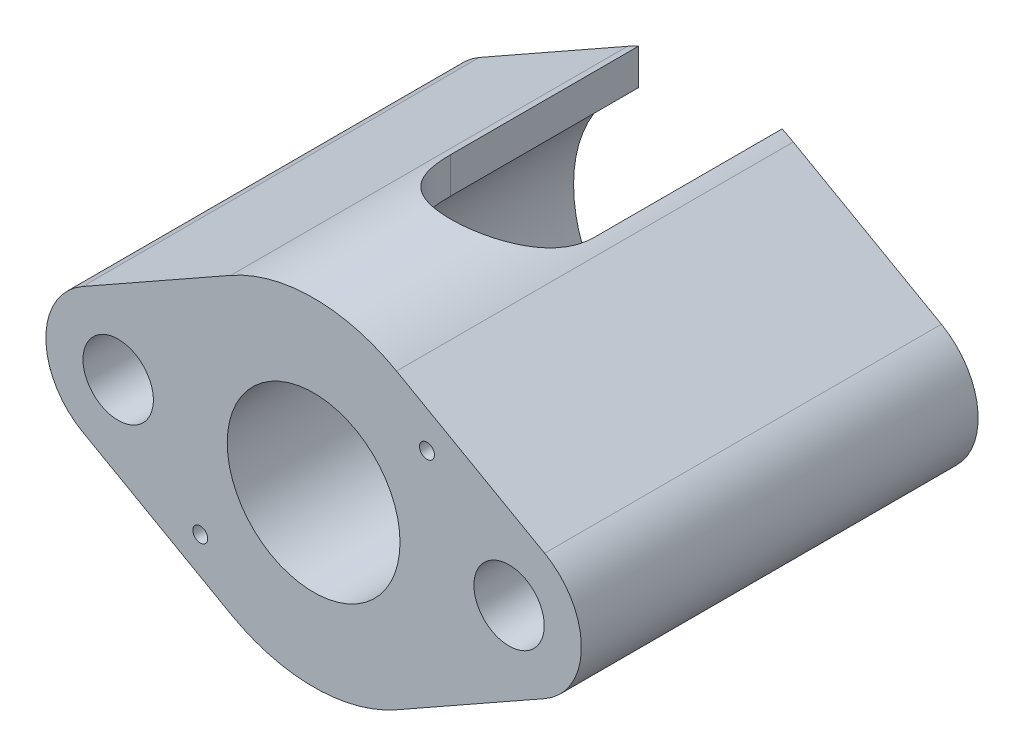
ISO-10303-21;
HEADER;
FILE_DESCRIPTION(('STEP AP214'),'2;1');
FILE_NAME('part.step','',(''),(''),'','','');
FILE_SCHEMA(('AUTOMOTIVE_DESIGN { 1 0 10303 214 1 1 1 1 }'));
ENDSEC;
DATA;
#1=APPLICATION_CONTEXT('core data for automotive mechanical design processes');
#2=APPLICATION_PROTOCOL_DEFINITION('international standard','automotive_design',2000,#1);
#3=PRODUCT_CONTEXT('',#1,'mechanical');
#4=PRODUCT('Part','Part','',(#3));
#5=PRODUCT_RELATED_PRODUCT_CATEGORY('part','',(#4));
#6=PRODUCT_DEFINITION_FORMATION('','',#4);
#7=PRODUCT_DEFINITION_CONTEXT('part definition',#1,'design');
#8=PRODUCT_DEFINITION('design','',#6,#7);
#9=PRODUCT_DEFINITION_SHAPE('','',#8);
#10=(LENGTH_UNIT() NAMED_UNIT(*) SI_UNIT(.MILLI.,.METRE.));
#11=(NAMED_UNIT(*) PLANE_ANGLE_UNIT() SI_UNIT($,.RADIAN.));
#12=(NAMED_UNIT(*) SI_UNIT($,.STERADIAN.) SOLID_ANGLE_UNIT());
#13=UNCERTAINTY_MEASURE_WITH_UNIT(LENGTH_MEASURE(1.E-05),#10,'distance_accuracy_value','');
#14=(GEOMETRIC_REPRESENTATION_CONTEXT(3) GLOBAL_UNCERTAINTY_ASSIGNED_CONTEXT((#13)) GLOBAL_UNIT_ASSIGNED_CONTEXT((#10,
#11,#12)) REPRESENTATION_CONTEXT('',''));
#15=CARTESIAN_POINT('',(0.,0.,0.));
#16=DIRECTION('',(0.,0.,1.));
#17=DIRECTION('',(1.,0.,0.));
#18=AXIS2_PLACEMENT_3D('',#15,#16,#17);
#19=CARTESIAN_POINT('',(12.7,0.,0.));
#20=DIRECTION('',(0.,0.,1.));
#21=DIRECTION('',(1.,0.,0.));
#22=AXIS2_PLACEMENT_3D('',#19,#20,#21);
#23=PLANE('',#22);
#24=CARTESIAN_POINT('',(12.7,0.,0.));
#25=DIRECTION('',(0.,0.,1.));
#26=DIRECTION('',(1.,0.,0.));
#27=AXIS2_PLACEMENT_3D('',#24,#25,#26);
#28=CIRCLE('',#27,2.286);
#29=CARTESIAN_POINT('',(14.986,0.,0.));
#30=VERTEX_POINT('',#29);
#31=EDGE_CURVE('E287',#30,#30,#28,.T.);
#32=ORIENTED_EDGE('',*,*,#31,.T.);
#33=EDGE_LOOP('',(#32));
#34=FACE_BOUND('',#33,.T.);
#35=CARTESIAN_POINT('',(0.,0.,0.));
#36=DIRECTION('',(0.,0.,1.));
#37=DIRECTION('',(-1.,0.,0.));
#38=AXIS2_PLACEMENT_3D('',#35,#36,#37);
#39=CIRCLE('',#38,10.9474);
#40=CARTESIAN_POINT('',(4.6609,-9.90563364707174,0.));
#41=VERTEX_POINT('',#40);
#42=CARTESIAN_POINT('',(5.3861208,-9.53075387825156,0.));
#43=VERTEX_POINT('',#42);
#44=EDGE_CURVE('E290',#41,#43,#39,.T.);
#45=ORIENTED_EDGE('',*,*,#44,.F.);
#46=DIRECTION('',(0.,1.,0.));
#47=VECTOR('',#46,1.);
#48=CARTESIAN_POINT('',(4.6609,-10.9474,0.));
#49=LINE('',#48,#47);
#50=CARTESIAN_POINT('',(4.6609,-7.57021209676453,0.));
#51=VERTEX_POINT('',#50);
#52=EDGE_CURVE('E189',#41,#51,#49,.T.);
#53=ORIENTED_EDGE('',*,*,#52,.T.);
#54=CARTESIAN_POINT('',(0.,0.,0.));
#55=DIRECTION('',(0.,0.,-1.));
#56=DIRECTION('',(-1.,0.,0.));
#57=AXIS2_PLACEMENT_3D('',#54,#55,#56);
#58=CIRCLE('',#57,8.89);
#59=CARTESIAN_POINT('',(4.6609,7.57021209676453,0.));
#60=VERTEX_POINT('',#59);
#61=EDGE_CURVE('E398',#60,#51,#58,.T.);
#62=ORIENTED_EDGE('',*,*,#61,.F.);
#63=CARTESIAN_POINT('',(4.6609,9.90563364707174,0.));
#64=VERTEX_POINT('',#63);
#65=EDGE_CURVE('E197',#60,#64,#49,.T.);
#66=ORIENTED_EDGE('',*,*,#65,.T.);
#67=CARTESIAN_POINT('',(0.,0.,0.));
#68=DIRECTION('',(0.,0.,1.));
#69=DIRECTION('',(1.,0.,0.));
#70=AXIS2_PLACEMENT_3D('',#67,#68,#69);
#71=CIRCLE('',#70,10.9474);
#72=CARTESIAN_POINT('',(5.3861208,9.53075387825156,0.));
#73=VERTEX_POINT('',#72);
#74=EDGE_CURVE('E393',#73,#64,#71,.T.);
#75=ORIENTED_EDGE('',*,*,#74,.F.);
#76=DIRECTION('',(-0.870595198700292,0.491999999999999,0.));
#77=VECTOR('',#76,1.);
#78=CARTESIAN_POINT('',(5.3861208,9.53075387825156,0.));
#79=LINE('',#78,#77);
#80=CARTESIAN_POINT('',(15.011908,4.09092683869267,0.));
#81=VERTEX_POINT('',#80);
#82=EDGE_CURVE('E448',#81,#73,#79,.T.);
#83=ORIENTED_EDGE('',*,*,#82,.F.);
#84=CARTESIAN_POINT('',(12.7,0.,0.));
#85=DIRECTION('',(0.,0.,1.));
#86=DIRECTION('',(1.,0.,0.));
#87=AXIS2_PLACEMENT_3D('',#84,#85,#86);
#88=CIRCLE('',#87,4.699);
#89=CARTESIAN_POINT('',(15.011908,-4.09092683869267,0.));
#90=VERTEX_POINT('',#89);
#91=EDGE_CURVE('E420',#90,#81,#88,.T.);
#92=ORIENTED_EDGE('',*,*,#91,.F.);
#93=DIRECTION('',(0.870595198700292,0.491999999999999,0.));
#94=VECTOR('',#93,1.);
#95=CARTESIAN_POINT('',(5.3861208,-9.53075387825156,0.));
#96=LINE('',#95,#94);
#97=EDGE_CURVE('E294',#43,#90,#96,.T.);
#98=ORIENTED_EDGE('',*,*,#97,.F.);
#99=EDGE_LOOP('',(#45,#53,#62,#66,#75,#83,#92,#98));
#100=FACE_BOUND('',#99,.T.);
#101=ADVANCED_FACE('F47',(#34,#100),#23,.F.);
#102=CARTESIAN_POINT('',(0.,0.,25.781));
#103=DIRECTION('',(0.,0.,-1.));
#104=DIRECTION('',(-1.,0.,0.));
#105=AXIS2_PLACEMENT_3D('',#102,#103,#104);
#106=CYLINDRICAL_SURFACE('',#105,5.6134);
#107=CARTESIAN_POINT('',(0.,0.,25.781));
#108=DIRECTION('',(0.,0.,1.));
#109=DIRECTION('',(1.,0.,0.));
#110=AXIS2_PLACEMENT_3D('',#107,#108,#109);
#111=CIRCLE('',#110,5.6134);
#112=CARTESIAN_POINT('',(5.6134,0.,25.781));
#113=VERTEX_POINT('',#112);
#114=EDGE_CURVE('E409',#113,#113,#111,.T.);
#115=ORIENTED_EDGE('',*,*,#114,.T.);
#116=EDGE_LOOP('',(#115));
#117=FACE_BOUND('',#116,.T.);
#118=CARTESIAN_POINT('',(0.,0.,17.2466));
#119=DIRECTION('',(0.,0.,-1.));
#120=DIRECTION('',(-1.,0.,0.));
#121=AXIS2_PLACEMENT_3D('',#118,#119,#120);
#122=CIRCLE('',#121,5.6134);
#123=CARTESIAN_POINT('',(-5.6134,0.,17.2466));
#124=VERTEX_POINT('',#123);
#125=EDGE_CURVE('E340',#124,#124,#122,.T.);
#126=ORIENTED_EDGE('',*,*,#125,.T.);
#127=EDGE_LOOP('',(#126));
#128=FACE_BOUND('',#127,.T.);
#129=ADVANCED_FACE('F259',(#117,#128),#106,.F.);
#130=CARTESIAN_POINT('',(12.7,0.,25.781));
#131=DIRECTION('',(0.,0.,1.));
#132=DIRECTION('',(1.,0.,0.));
#133=AXIS2_PLACEMENT_3D('',#130,#131,#132);
#134=PLANE('',#133);
#135=CARTESIAN_POINT('',(7.366,6.03884666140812,25.781));
#136=DIRECTION('',(0.,0.,1.));
#137=DIRECTION('',(1.,0.,0.));
#138=AXIS2_PLACEMENT_3D('',#135,#136,#137);
#139=CIRCLE('',#138,0.482599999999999);
#140=CARTESIAN_POINT('',(7.8486,6.03884666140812,25.781));
#141=VERTEX_POINT('',#140);
#142=EDGE_CURVE('E367',#141,#141,#139,.T.);
#143=ORIENTED_EDGE('',*,*,#142,.F.);
#144=EDGE_LOOP('',(#143));
#145=FACE_BOUND('',#144,.T.);
#146=CARTESIAN_POINT('',(-7.36599999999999,-6.03884666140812,25.781));
#147=DIRECTION('',(0.,0.,1.));
#148=DIRECTION('',(1.,0.,0.));
#149=AXIS2_PLACEMENT_3D('',#146,#147,#148);
#150=CIRCLE('',#149,0.482599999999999);
#151=CARTESIAN_POINT('',(-6.8834,-6.03884666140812,25.781));
#152=VERTEX_POINT('',#151);
#153=EDGE_CURVE('E377',#152,#152,#150,.T.);
#154=ORIENTED_EDGE('',*,*,#153,.F.);
#155=EDGE_LOOP('',(#154));
#156=FACE_BOUND('',#155,.T.);
#157=ORIENTED_EDGE('',*,*,#114,.F.);
#158=EDGE_LOOP('',(#157));
#159=FACE_BOUND('',#158,.T.);
#160=CARTESIAN_POINT('',(12.7,0.,25.781));
#161=DIRECTION('',(0.,0.,1.));
#162=DIRECTION('',(1.,0.,0.));
#163=AXIS2_PLACEMENT_3D('',#160,#161,#162);
#164=CIRCLE('',#163,4.699);
#165=CARTESIAN_POINT('',(15.011908,-4.09092683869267,25.781));
#166=VERTEX_POINT('',#165);
#167=CARTESIAN_POINT('',(15.011908,4.09092683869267,25.781));
#168=VERTEX_POINT('',#167);
#169=EDGE_CURVE('E309',#166,#168,#164,.T.);
#170=ORIENTED_EDGE('',*,*,#169,.T.);
#171=DIRECTION('',(-0.870595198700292,0.491999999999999,0.));
#172=VECTOR('',#171,1.);
#173=CARTESIAN_POINT('',(5.3861208,9.53075387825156,25.781));
#174=LINE('',#173,#172);
#175=CARTESIAN_POINT('',(5.3861208,9.53075387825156,25.781));
#176=VERTEX_POINT('',#175);
#177=EDGE_CURVE('E425',#168,#176,#174,.T.);
#178=ORIENTED_EDGE('',*,*,#177,.T.);
#179=CARTESIAN_POINT('',(0.,0.,25.781));
#180=DIRECTION('',(0.,0.,1.));
#181=DIRECTION('',(1.,0.,0.));
#182=AXIS2_PLACEMENT_3D('',#179,#180,#181);
#183=CIRCLE('',#182,10.9474);
#184=CARTESIAN_POINT('',(-5.3861208,9.53075387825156,25.781));
#185=VERTEX_POINT('',#184);
#186=EDGE_CURVE('E428',#176,#185,#183,.T.);
#187=ORIENTED_EDGE('',*,*,#186,.T.);
#188=DIRECTION('',(-0.870595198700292,-0.491999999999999,0.));
#189=VECTOR('',#188,1.);
#190=CARTESIAN_POINT('',(-5.3861208,9.53075387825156,25.781));
#191=LINE('',#190,#189);
#192=CARTESIAN_POINT('',(-15.011908,4.09092683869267,25.781));
#193=VERTEX_POINT('',#192);
#194=EDGE_CURVE('E431',#185,#193,#191,.T.);
#195=ORIENTED_EDGE('',*,*,#194,.T.);
#196=CARTESIAN_POINT('',(-12.7,0.,25.781));
#197=DIRECTION('',(0.,0.,1.));
#198=DIRECTION('',(-1.,0.,0.));
#199=AXIS2_PLACEMENT_3D('',#196,#197,#198);
#200=CIRCLE('',#199,4.699);
#201=CARTESIAN_POINT('',(-15.011908,-4.09092683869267,25.781));
#202=VERTEX_POINT('',#201);
#203=EDGE_CURVE('E434',#193,#202,#200,.T.);
#204=ORIENTED_EDGE('',*,*,#203,.T.);
#205=DIRECTION('',(0.870595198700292,-0.491999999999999,0.));
#206=VECTOR('',#205,1.);
#207=CARTESIAN_POINT('',(-5.38612079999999,-9.53075387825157,25.781));
#208=LINE('',#207,#206);
#209=CARTESIAN_POINT('',(-5.38612079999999,-9.53075387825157,25.781));
#210=VERTEX_POINT('',#209);
#211=EDGE_CURVE('E437',#202,#210,#208,.T.);
#212=ORIENTED_EDGE('',*,*,#211,.T.);
#213=CARTESIAN_POINT('',(0.,0.,25.781));
#214=DIRECTION('',(0.,0.,1.));
#215=DIRECTION('',(-1.,0.,0.));
#216=AXIS2_PLACEMENT_3D('',#213,#214,#215);
#217=CIRCLE('',#216,10.9474);
#218=CARTESIAN_POINT('',(5.3861208,-9.53075387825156,25.781));
#219=VERTEX_POINT('',#218);
#220=EDGE_CURVE('E440',#210,#219,#217,.T.);
#221=ORIENTED_EDGE('',*,*,#220,.T.);
#222=DIRECTION('',(0.870595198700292,0.491999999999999,0.));
#223=VECTOR('',#222,1.);
#224=CARTESIAN_POINT('',(5.3861208,-9.53075387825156,25.781));
#225=LINE('',#224,#223);
#226=EDGE_CURVE('E315',#219,#166,#225,.T.);
#227=ORIENTED_EDGE('',*,*,#226,.T.);
#228=EDGE_LOOP('',(#170,#178,#187,#195,#204,#212,#221,#227));
#229=FACE_BOUND('',#228,.T.);
#230=CARTESIAN_POINT('',(12.7,0.,25.781));
#231=DIRECTION('',(0.,0.,1.));
#232=DIRECTION('',(1.,0.,0.));
#233=AXIS2_PLACEMENT_3D('',#230,#231,#232);
#234=CIRCLE('',#233,2.286);
#235=CARTESIAN_POINT('',(14.986,0.,25.781));
#236=VERTEX_POINT('',#235);
#237=EDGE_CURVE('E416',#236,#236,#234,.T.);
#238=ORIENTED_EDGE('',*,*,#237,.F.);
#239=EDGE_LOOP('',(#238));
#240=FACE_BOUND('',#239,.T.);
#241=CARTESIAN_POINT('',(-12.7,0.,25.781));
#242=DIRECTION('',(0.,0.,1.));
#243=DIRECTION('',(-1.,0.,0.));
#244=AXIS2_PLACEMENT_3D('',#241,#242,#243);
#245=CIRCLE('',#244,2.286);
#246=CARTESIAN_POINT('',(-14.986,0.,25.781));
#247=VERTEX_POINT('',#246);
#248=EDGE_CURVE('E405',#247,#247,#245,.T.);
#249=ORIENTED_EDGE('',*,*,#248,.F.);
#250=EDGE_LOOP('',(#249));
#251=FACE_BOUND('',#250,.T.);
#252=ADVANCED_FACE('F262',(#145,#156,#159,#229,#240,#251),#134,.T.);
#253=CARTESIAN_POINT('',(-4.6609,9.90563364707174,0.));
#254=VERTEX_POINT('',#253);
#255=CARTESIAN_POINT('',(-5.3861208,9.53075387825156,0.));
#256=VERTEX_POINT('',#255);
#257=EDGE_CURVE('E360',#254,#256,#71,.T.);
#258=ORIENTED_EDGE('',*,*,#257,.F.);
#259=DIRECTION('',(0.,1.,0.));
#260=VECTOR('',#259,1.);
#261=CARTESIAN_POINT('',(-4.6609,-10.9474,0.));
#262=LINE('',#261,#260);
#263=CARTESIAN_POINT('',(-4.6609,7.57021209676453,0.));
#264=VERTEX_POINT('',#263);
#265=EDGE_CURVE('E200',#264,#254,#262,.T.);
#266=ORIENTED_EDGE('',*,*,#265,.F.);
#267=CARTESIAN_POINT('',(-4.6609,-7.57021209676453,0.));
#268=VERTEX_POINT('',#267);
#269=EDGE_CURVE('E355',#268,#264,#58,.T.);
#270=ORIENTED_EDGE('',*,*,#269,.F.);
#271=CARTESIAN_POINT('',(-4.6609,-9.90563364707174,0.));
#272=VERTEX_POINT('',#271);
#273=EDGE_CURVE('E71',#272,#268,#262,.T.);
#274=ORIENTED_EDGE('',*,*,#273,.F.);
#275=CARTESIAN_POINT('',(-5.38612079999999,-9.53075387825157,0.));
#276=VERTEX_POINT('',#275);
#277=EDGE_CURVE('E187',#276,#272,#39,.T.);
#278=ORIENTED_EDGE('',*,*,#277,.F.);
#279=DIRECTION('',(0.870595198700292,-0.491999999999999,0.));
#280=VECTOR('',#279,1.);
#281=CARTESIAN_POINT('',(-5.38612079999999,-9.53075387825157,0.));
#282=LINE('',#281,#280);
#283=CARTESIAN_POINT('',(-15.011908,-4.09092683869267,0.));
#284=VERTEX_POINT('',#283);
#285=EDGE_CURVE('E298',#284,#276,#282,.T.);
#286=ORIENTED_EDGE('',*,*,#285,.F.);
#287=CARTESIAN_POINT('',(-12.7,0.,0.));
#288=DIRECTION('',(0.,0.,1.));
#289=DIRECTION('',(-1.,0.,0.));
#290=AXIS2_PLACEMENT_3D('',#287,#288,#289);
#291=CIRCLE('',#290,4.699);
#292=CARTESIAN_POINT('',(-15.011908,4.09092683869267,0.));
#293=VERTEX_POINT('',#292);
#294=EDGE_CURVE('E303',#293,#284,#291,.T.);
#295=ORIENTED_EDGE('',*,*,#294,.F.);
#296=DIRECTION('',(-0.870595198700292,-0.491999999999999,0.));
#297=VECTOR('',#296,1.);
#298=CARTESIAN_POINT('',(-5.3861208,9.53075387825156,0.));
#299=LINE('',#298,#297);
#300=EDGE_CURVE('E453',#256,#293,#299,.T.);
#301=ORIENTED_EDGE('',*,*,#300,.F.);
#302=EDGE_LOOP('',(#258,#266,#270,#274,#278,#286,#295,#301));
#303=FACE_BOUND('',#302,.T.);
#304=CARTESIAN_POINT('',(-12.7,0.,0.));
#305=DIRECTION('',(0.,0.,1.));
#306=DIRECTION('',(-1.,0.,0.));
#307=AXIS2_PLACEMENT_3D('',#304,#305,#306);
#308=CIRCLE('',#307,2.286);
#309=CARTESIAN_POINT('',(-14.986,0.,0.));
#310=VERTEX_POINT('',#309);
#311=EDGE_CURVE('E343',#310,#310,#308,.T.);
#312=ORIENTED_EDGE('',*,*,#311,.T.);
#313=EDGE_LOOP('',(#312));
#314=FACE_BOUND('',#313,.T.);
#315=ADVANCED_FACE('F270',(#303,#314),#23,.F.);
#316=CARTESIAN_POINT('',(12.7,0.,25.781));
#317=DIRECTION('',(0.,0.,-1.));
#318=DIRECTION('',(-1.,0.,0.));
#319=AXIS2_PLACEMENT_3D('',#316,#317,#318);
#320=CYLINDRICAL_SURFACE('',#319,4.699);
#321=ORIENTED_EDGE('',*,*,#91,.T.);
#322=DIRECTION('',(0.,0.,-1.));
#323=VECTOR('',#322,1.);
#324=CARTESIAN_POINT('',(15.011908,4.09092683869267,25.781));
#325=LINE('',#324,#323);
#326=EDGE_CURVE('E336',#168,#81,#325,.T.);
#327=ORIENTED_EDGE('',*,*,#326,.F.);
#328=ORIENTED_EDGE('',*,*,#169,.F.);
#329=DIRECTION('',(0.,0.,-1.));
#330=VECTOR('',#329,1.);
#331=CARTESIAN_POINT('',(15.011908,-4.09092683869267,25.781));
#332=LINE('',#331,#330);
#333=EDGE_CURVE('E310',#166,#90,#332,.T.);
#334=ORIENTED_EDGE('',*,*,#333,.T.);
#335=EDGE_LOOP('',(#321,#327,#328,#334));
#336=FACE_BOUND('',#335,.T.);
#337=ADVANCED_FACE('F49',(#336),#320,.T.);
#338=CARTESIAN_POINT('',(5.3861208,9.53075387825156,25.781));
#339=DIRECTION('',(-0.491999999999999,-0.870595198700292,0.));
#340=DIRECTION('',(0.870595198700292,-0.491999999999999,0.));
#341=AXIS2_PLACEMENT_3D('',#338,#339,#340);
#342=PLANE('',#341);
#343=ORIENTED_EDGE('',*,*,#82,.T.);
#344=DIRECTION('',(0.,0.,-1.));
#345=VECTOR('',#344,1.);
#346=CARTESIAN_POINT('',(5.3861208,9.53075387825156,25.781));
#347=LINE('',#346,#345);
#348=EDGE_CURVE('E332',#176,#73,#347,.T.);
#349=ORIENTED_EDGE('',*,*,#348,.F.);
#350=ORIENTED_EDGE('',*,*,#177,.F.);
#351=ORIENTED_EDGE('',*,*,#326,.T.);
#352=EDGE_LOOP('',(#343,#349,#350,#351));
#353=FACE_BOUND('',#352,.T.);
#354=ADVANCED_FACE('F478',(#353),#342,.F.);
#355=CARTESIAN_POINT('',(0.,0.,25.781));
#356=DIRECTION('',(0.,0.,-1.));
#357=DIRECTION('',(-1.,0.,0.));
#358=AXIS2_PLACEMENT_3D('',#355,#356,#357);
#359=CYLINDRICAL_SURFACE('',#358,10.9474);
#360=ORIENTED_EDGE('',*,*,#74,.T.);
#361=DIRECTION('',(0.,0.,-1.));
#362=VECTOR('',#361,1.);
#363=CARTESIAN_POINT('',(4.6609,9.90563364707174,25.781));
#364=LINE('',#363,#362);
#365=CARTESIAN_POINT('',(4.6609,9.90563364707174,12.2301));
#366=VERTEX_POINT('',#365);
#367=EDGE_CURVE('E388',#64,#366,#364,.F.);
#368=ORIENTED_EDGE('',*,*,#367,.T.);
#369=CARTESIAN_POINT('',(4.6609,9.90563364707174,12.2301));
#370=CARTESIAN_POINT('',(4.66091941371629,9.90560553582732,12.3547135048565));
#371=CARTESIAN_POINT('',(4.65590308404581,9.90798442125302,12.4793116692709));
#372=CARTESIAN_POINT('',(4.63595082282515,9.91734578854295,12.7274847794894));
#373=CARTESIAN_POINT('',(4.62101917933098,9.92432628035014,12.8510601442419));
#374=CARTESIAN_POINT('',(4.58147420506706,9.94264084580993,13.095770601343));
#375=CARTESIAN_POINT('',(4.55690330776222,9.95395583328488,13.2169139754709));
#376=CARTESIAN_POINT('',(4.49836655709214,9.98054578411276,13.4564382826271));
#377=CARTESIAN_POINT('',(4.46440002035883,9.99582103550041,13.5748190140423));
#378=CARTESIAN_POINT('',(4.34897973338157,10.0468443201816,13.9243207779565));
#379=CARTESIAN_POINT('',(4.25391596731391,10.0878339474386,14.1503449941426));
#380=CARTESIAN_POINT('',(4.03059536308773,10.1791130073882,14.5833579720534));
#381=CARTESIAN_POINT('',(3.90230220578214,10.2294125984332,14.7903255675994));
#382=CARTESIAN_POINT('',(3.60739674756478,10.3372294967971,15.192607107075));
#383=CARTESIAN_POINT('',(3.43898422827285,10.3949967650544,15.3865347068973));
#384=CARTESIAN_POINT('',(3.07227149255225,10.509208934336,15.7444601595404));
#385=CARTESIAN_POINT('',(2.87396473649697,10.5656535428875,15.9084514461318));
#386=CARTESIAN_POINT('',(2.55269024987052,10.646236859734,16.1321372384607));
#387=CARTESIAN_POINT('',(2.43885222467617,10.6729529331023,16.2042933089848));
#388=CARTESIAN_POINT('',(2.2049194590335,10.7237209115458,16.3386871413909));
#389=CARTESIAN_POINT('',(2.08482731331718,10.7477739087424,16.4009289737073));
#390=CARTESIAN_POINT('',(1.83915982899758,10.7925276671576,16.5149365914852));
#391=CARTESIAN_POINT('',(1.71358406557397,10.8132281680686,16.5667015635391));
#392=CARTESIAN_POINT('',(1.45792017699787,10.8506548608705,16.659199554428));
#393=CARTESIAN_POINT('',(1.32783436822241,10.8673830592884,16.6999381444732));
#394=CARTESIAN_POINT('',(1.07120297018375,10.8955886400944,16.7680711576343));
#395=CARTESIAN_POINT('',(0.94484181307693,10.9072995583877,16.7960641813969));
#396=CARTESIAN_POINT('',(0.689961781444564,10.9263827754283,16.8414650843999));
#397=CARTESIAN_POINT('',(0.561443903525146,10.933757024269,16.8588777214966));
#398=CARTESIAN_POINT('',(0.303241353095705,10.9439619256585,16.8829317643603));
#399=CARTESIAN_POINT('',(0.173556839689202,10.9467931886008,16.8895746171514));
#400=CARTESIAN_POINT('',(-0.0859301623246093,10.9478314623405,16.8920135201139));
#401=CARTESIAN_POINT('',(-0.215732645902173,10.94603866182,16.8878100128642));
#402=CARTESIAN_POINT('',(-0.466135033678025,10.9381426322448,16.8692216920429));
#403=CARTESIAN_POINT('',(-0.586793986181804,10.9323215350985,16.8555031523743));
#404=CARTESIAN_POINT('',(-0.826470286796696,10.9168192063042,16.8187426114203));
#405=CARTESIAN_POINT('',(-0.945487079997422,10.9071367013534,16.7956975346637));
#406=CARTESIAN_POINT('',(-1.18099623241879,10.8841536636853,16.7405161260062));
#407=CARTESIAN_POINT('',(-1.29748945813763,10.8708543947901,16.7083829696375));
#408=CARTESIAN_POINT('',(-1.52726672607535,10.8409631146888,16.6353246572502));
#409=CARTESIAN_POINT('',(-1.64054952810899,10.8243698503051,16.5943961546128));
#410=CARTESIAN_POINT('',(-1.97784989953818,10.769674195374,16.4575627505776));
#411=CARTESIAN_POINT('',(-2.19592343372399,10.727002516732,16.3484099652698));
#412=CARTESIAN_POINT('',(-2.61111908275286,10.6335829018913,16.0985476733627));
#413=CARTESIAN_POINT('',(-2.80823340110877,10.5828319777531,15.9578264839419));
#414=CARTESIAN_POINT('',(-3.19136236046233,10.4739320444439,15.6368752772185));
#415=CARTESIAN_POINT('',(-3.37551360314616,10.4155134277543,15.4545097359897));
#416=CARTESIAN_POINT('',(-3.71152391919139,10.300571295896,15.0612541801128));
#417=CARTESIAN_POINT('',(-3.86336559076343,10.2440488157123,14.850348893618));
#418=CARTESIAN_POINT('',(-4.06617328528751,10.1645139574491,14.5122899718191));
#419=CARTESIAN_POINT('',(-4.13051587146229,10.1384669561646,14.3936849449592));
#420=CARTESIAN_POINT('',(-4.24887599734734,10.0894360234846,14.1508445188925));
#421=CARTESIAN_POINT('',(-4.30289804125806,10.0664507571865,14.0266116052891));
#422=CARTESIAN_POINT('',(-4.40002650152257,10.0243772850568,13.7735075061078));
#423=CARTESIAN_POINT('',(-4.44314756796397,10.0052838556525,13.6446428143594));
#424=CARTESIAN_POINT('',(-4.51807345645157,9.97167248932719,13.3831383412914));
#425=CARTESIAN_POINT('',(-4.54988331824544,9.95715251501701,13.2505002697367));
#426=CARTESIAN_POINT('',(-4.60403341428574,9.93224394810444,12.9709199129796));
#427=CARTESIAN_POINT('',(-4.62532098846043,9.92231937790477,12.8237301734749));
#428=CARTESIAN_POINT('',(-4.65377396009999,9.90898577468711,12.527734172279));
#429=CARTESIAN_POINT('',(-4.66094213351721,9.90557546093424,12.3789282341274));
#430=CARTESIAN_POINT('',(-4.6609,9.90563364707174,12.2301));
#431=B_SPLINE_CURVE_WITH_KNOTS('',3,(#369,#370,#371,#372,#373,#374,#375,#376,#377,#378,#379,
#380,#381,#382,#383,#384,#385,#386,#387,#388,#389,#390,#391,#392,#393,#394,#395,#396,#397,#398,
#399,#400,#401,#402,#403,#404,#405,#406,#407,#408,#409,#410,#411,#412,#413,#414,#415,#416,#417,
#418,#419,#420,#421,#422,#423,#424,#425,#426,#427,#428,#429,#430),.UNSPECIFIED.,.F.,.F.,(4,2,2,
2,2,2,2,2,2,2,2,2,2,2,2,2,2,2,2,2,2,2,2,2,2,2,2,2,2,2,4),(0.,0.373691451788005,
0.747221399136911,1.11912513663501,1.49105593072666,2.23328037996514,2.9763195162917,
3.76274996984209,4.54935271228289,4.96112017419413,5.37271814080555,5.78434805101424,
6.19576959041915,6.58512089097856,6.97429697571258,7.36342076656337,7.752528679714,
8.11682615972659,8.4812438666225,8.84553439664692,9.20996378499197,9.94921716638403,
10.6887445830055,11.4823075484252,12.2762968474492,12.6881248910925,13.099772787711,
13.5108644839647,13.9217727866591,14.3681018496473,14.8143431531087),.UNSPECIFIED.);
#432=CARTESIAN_POINT('',(-4.6609,9.90563364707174,12.2301));
#433=VERTEX_POINT('',#432);
#434=EDGE_CURVE('E174',#366,#433,#431,.T.);
#435=ORIENTED_EDGE('',*,*,#434,.T.);
#436=DIRECTION('',(0.,0.,-1.));
#437=VECTOR('',#436,1.);
#438=CARTESIAN_POINT('',(-4.6609,9.90563364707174,25.781));
#439=LINE('',#438,#437);
#440=EDGE_CURVE('E175',#433,#254,#439,.T.);
#441=ORIENTED_EDGE('',*,*,#440,.T.);
#442=ORIENTED_EDGE('',*,*,#257,.T.);
#443=DIRECTION('',(0.,0.,-1.));
#444=VECTOR('',#443,1.);
#445=CARTESIAN_POINT('',(-5.3861208,9.53075387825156,25.781));
#446=LINE('',#445,#444);
#447=EDGE_CURVE('E328',#185,#256,#446,.T.);
#448=ORIENTED_EDGE('',*,*,#447,.F.);
#449=ORIENTED_EDGE('',*,*,#186,.F.);
#450=ORIENTED_EDGE('',*,*,#348,.T.);
#451=EDGE_LOOP('',(#360,#368,#435,#441,#442,#448,#449,#450));
#452=FACE_BOUND('',#451,.T.);
#453=ADVANCED_FACE('F391',(#452),#359,.T.);
#454=CARTESIAN_POINT('',(-5.3861208,9.53075387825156,25.781));
#455=DIRECTION('',(0.491999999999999,-0.870595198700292,0.));
#456=DIRECTION('',(0.870595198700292,0.491999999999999,0.));
#457=AXIS2_PLACEMENT_3D('',#454,#455,#456);
#458=PLANE('',#457);
#459=ORIENTED_EDGE('',*,*,#300,.T.);
#460=DIRECTION('',(0.,0.,-1.));
#461=VECTOR('',#460,1.);
#462=CARTESIAN_POINT('',(-15.011908,4.09092683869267,25.781));
#463=LINE('',#462,#461);
#464=EDGE_CURVE('E324',#193,#293,#463,.T.);
#465=ORIENTED_EDGE('',*,*,#464,.F.);
#466=ORIENTED_EDGE('',*,*,#194,.F.);
#467=ORIENTED_EDGE('',*,*,#447,.T.);
#468=EDGE_LOOP('',(#459,#465,#466,#467));
#469=FACE_BOUND('',#468,.T.);
#470=ADVANCED_FACE('F473',(#469),#458,.F.);
#471=CARTESIAN_POINT('',(-12.7,0.,25.781));
#472=DIRECTION('',(0.,0.,-1.));
#473=DIRECTION('',(-1.,0.,0.));
#474=AXIS2_PLACEMENT_3D('',#471,#472,#473);
#475=CYLINDRICAL_SURFACE('',#474,4.699);
#476=ORIENTED_EDGE('',*,*,#294,.T.);
#477=DIRECTION('',(0.,0.,-1.));
#478=VECTOR('',#477,1.);
#479=CARTESIAN_POINT('',(-15.011908,-4.09092683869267,25.781));
#480=LINE('',#479,#478);
#481=EDGE_CURVE('E320',#202,#284,#480,.T.);
#482=ORIENTED_EDGE('',*,*,#481,.F.);
#483=ORIENTED_EDGE('',*,*,#203,.F.);
#484=ORIENTED_EDGE('',*,*,#464,.T.);
#485=EDGE_LOOP('',(#476,#482,#483,#484));
#486=FACE_BOUND('',#485,.T.);
#487=ADVANCED_FACE('F459',(#486),#475,.T.);
#488=CARTESIAN_POINT('',(-5.38612079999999,-9.53075387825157,25.781));
#489=DIRECTION('',(0.491999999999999,0.870595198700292,0.));
#490=DIRECTION('',(-0.870595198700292,0.491999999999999,0.));
#491=AXIS2_PLACEMENT_3D('',#488,#489,#490);
#492=PLANE('',#491);
#493=ORIENTED_EDGE('',*,*,#285,.T.);
#494=DIRECTION('',(0.,0.,-1.));
#495=VECTOR('',#494,1.);
#496=CARTESIAN_POINT('',(-5.38612079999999,-9.53075387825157,25.781));
#497=LINE('',#496,#495);
#498=EDGE_CURVE('E318',#210,#276,#497,.T.);
#499=ORIENTED_EDGE('',*,*,#498,.F.);
#500=ORIENTED_EDGE('',*,*,#211,.F.);
#501=ORIENTED_EDGE('',*,*,#481,.T.);
#502=EDGE_LOOP('',(#493,#499,#500,#501));
#503=FACE_BOUND('',#502,.T.);
#504=ADVANCED_FACE('F279',(#503),#492,.F.);
#505=CARTESIAN_POINT('',(0.,0.,25.781));
#506=DIRECTION('',(0.,0.,-1.));
#507=DIRECTION('',(-1.,0.,0.));
#508=AXIS2_PLACEMENT_3D('',#505,#506,#507);
#509=CYLINDRICAL_SURFACE('',#508,10.9474);
#510=DIRECTION('',(0.,0.,-1.));
#511=VECTOR('',#510,1.);
#512=CARTESIAN_POINT('',(-4.6609,-9.90563364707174,25.781));
#513=LINE('',#512,#511);
#514=CARTESIAN_POINT('',(-4.6609,-9.90563364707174,12.2301));
#515=VERTEX_POINT('',#514);
#516=EDGE_CURVE('E178',#272,#515,#513,.F.);
#517=ORIENTED_EDGE('',*,*,#516,.T.);
#518=CARTESIAN_POINT('',(-4.6609,-9.90563364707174,12.2301));
#519=CARTESIAN_POINT('',(-4.66091941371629,-9.90560553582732,12.3547135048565));
#520=CARTESIAN_POINT('',(-4.65590308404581,-9.90798442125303,12.4793116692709));
#521=CARTESIAN_POINT('',(-4.63595082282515,-9.91734578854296,12.7274847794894));
#522=CARTESIAN_POINT('',(-4.62101917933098,-9.92432628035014,12.8510601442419));
#523=CARTESIAN_POINT('',(-4.58147420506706,-9.94264084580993,13.095770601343));
#524=CARTESIAN_POINT('',(-4.55690330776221,-9.95395583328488,13.2169139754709));
#525=CARTESIAN_POINT('',(-4.49836655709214,-9.98054578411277,13.4564382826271));
#526=CARTESIAN_POINT('',(-4.46440002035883,-9.99582103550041,13.5748190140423));
#527=CARTESIAN_POINT('',(-4.34897973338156,-10.0468443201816,13.9243207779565));
#528=CARTESIAN_POINT('',(-4.25391596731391,-10.0878339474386,14.1503449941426));
#529=CARTESIAN_POINT('',(-4.03059536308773,-10.1791130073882,14.5833579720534));
#530=CARTESIAN_POINT('',(-3.90230220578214,-10.2294125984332,14.7903255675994));
#531=CARTESIAN_POINT('',(-3.60739674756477,-10.3372294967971,15.192607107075));
#532=CARTESIAN_POINT('',(-3.43898422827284,-10.3949967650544,15.3865347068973));
#533=CARTESIAN_POINT('',(-3.07227149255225,-10.509208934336,15.7444601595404));
#534=CARTESIAN_POINT('',(-2.87396473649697,-10.5656535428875,15.9084514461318));
#535=CARTESIAN_POINT('',(-2.55269024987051,-10.646236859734,16.1321372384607));
#536=CARTESIAN_POINT('',(-2.43885222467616,-10.6729529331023,16.2042933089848));
#537=CARTESIAN_POINT('',(-2.20491945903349,-10.7237209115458,16.3386871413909));
#538=CARTESIAN_POINT('',(-2.08482731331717,-10.7477739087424,16.4009289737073));
#539=CARTESIAN_POINT('',(-1.83915982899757,-10.7925276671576,16.5149365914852));
#540=CARTESIAN_POINT('',(-1.71358406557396,-10.8132281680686,16.5667015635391));
#541=CARTESIAN_POINT('',(-1.45792017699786,-10.8506548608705,16.659199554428));
#542=CARTESIAN_POINT('',(-1.3278343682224,-10.8673830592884,16.6999381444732));
#543=CARTESIAN_POINT('',(-1.07120297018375,-10.8955886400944,16.7680711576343));
#544=CARTESIAN_POINT('',(-0.944841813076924,-10.9072995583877,16.7960641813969));
#545=CARTESIAN_POINT('',(-0.689961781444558,-10.9263827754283,16.8414650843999));
#546=CARTESIAN_POINT('',(-0.56144390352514,-10.933757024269,16.8588777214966));
#547=CARTESIAN_POINT('',(-0.303241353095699,-10.9439619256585,16.8829317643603));
#548=CARTESIAN_POINT('',(-0.173556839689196,-10.9467931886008,16.8895746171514));
#549=CARTESIAN_POINT('',(0.085930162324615,-10.9478314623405,16.8920135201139));
#550=CARTESIAN_POINT('',(0.215732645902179,-10.94603866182,16.8878100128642));
#551=CARTESIAN_POINT('',(0.466135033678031,-10.9381426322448,16.8692216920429));
#552=CARTESIAN_POINT('',(0.586793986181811,-10.9323215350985,16.8555031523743));
#553=CARTESIAN_POINT('',(0.826470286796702,-10.9168192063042,16.8187426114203));
#554=CARTESIAN_POINT('',(0.945487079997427,-10.9071367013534,16.7956975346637));
#555=CARTESIAN_POINT('',(1.18099623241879,-10.8841536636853,16.7405161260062));
#556=CARTESIAN_POINT('',(1.29748945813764,-10.8708543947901,16.7083829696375));
#557=CARTESIAN_POINT('',(1.52726672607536,-10.8409631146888,16.6353246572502));
#558=CARTESIAN_POINT('',(1.640549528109,-10.8243698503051,16.5943961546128));
#559=CARTESIAN_POINT('',(1.97784989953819,-10.769674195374,16.4575627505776));
#560=CARTESIAN_POINT('',(2.19592343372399,-10.727002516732,16.3484099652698));
#561=CARTESIAN_POINT('',(2.61111908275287,-10.6335829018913,16.0985476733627));
#562=CARTESIAN_POINT('',(2.80823340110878,-10.5828319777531,15.9578264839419));
#563=CARTESIAN_POINT('',(3.19136236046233,-10.4739320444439,15.6368752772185));
#564=CARTESIAN_POINT('',(3.37551360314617,-10.4155134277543,15.4545097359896));
#565=CARTESIAN_POINT('',(3.71152391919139,-10.300571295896,15.0612541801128));
#566=CARTESIAN_POINT('',(3.86336559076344,-10.2440488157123,14.850348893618));
#567=CARTESIAN_POINT('',(4.06617328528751,-10.1645139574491,14.5122899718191));
#568=CARTESIAN_POINT('',(4.1305158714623,-10.1384669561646,14.3936849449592));
#569=CARTESIAN_POINT('',(4.24887599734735,-10.0894360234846,14.1508445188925));
#570=CARTESIAN_POINT('',(4.30289804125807,-10.0664507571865,14.0266116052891));
#571=CARTESIAN_POINT('',(4.40002650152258,-10.0243772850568,13.7735075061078));
#572=CARTESIAN_POINT('',(4.44314756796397,-10.0052838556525,13.6446428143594));
#573=CARTESIAN_POINT('',(4.51807345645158,-9.97167248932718,13.3831383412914));
#574=CARTESIAN_POINT('',(4.54988331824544,-9.95715251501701,13.2505002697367));
#575=CARTESIAN_POINT('',(4.60403341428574,-9.93224394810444,12.9709199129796));
#576=CARTESIAN_POINT('',(4.62532098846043,-9.92231937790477,12.8237301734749));
#577=CARTESIAN_POINT('',(4.65377396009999,-9.90898577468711,12.527734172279));
#578=CARTESIAN_POINT('',(4.66094213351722,-9.90557546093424,12.3789282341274));
#579=CARTESIAN_POINT('',(4.6609,-9.90563364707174,12.2301));
#580=B_SPLINE_CURVE_WITH_KNOTS('',3,(#518,#519,#520,#521,#522,#523,#524,#525,#526,#527,#528,
#529,#530,#531,#532,#533,#534,#535,#536,#537,#538,#539,#540,#541,#542,#543,#544,#545,#546,#547,
#548,#549,#550,#551,#552,#553,#554,#555,#556,#557,#558,#559,#560,#561,#562,#563,#564,#565,#566,
#567,#568,#569,#570,#571,#572,#573,#574,#575,#576,#577,#578,#579),.UNSPECIFIED.,.F.,.F.,(4,2,2,
2,2,2,2,2,2,2,2,2,2,2,2,2,2,2,2,2,2,2,2,2,2,2,2,2,2,2,4),(0.,0.373691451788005,
0.747221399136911,1.119125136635,1.49105593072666,2.23328037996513,2.9763195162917,
3.76274996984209,4.54935271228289,4.96112017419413,5.37271814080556,5.78434805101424,
6.19576959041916,6.58512089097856,6.97429697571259,7.36342076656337,7.752528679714,
8.11682615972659,8.4812438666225,8.84553439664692,9.20996378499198,9.94921716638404,
10.6887445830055,11.4823075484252,12.2762968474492,12.6881248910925,13.099772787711,
13.5108644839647,13.9217727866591,14.3681018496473,14.8143431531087),.UNSPECIFIED.);
#581=CARTESIAN_POINT('',(4.6609,-9.90563364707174,12.2301));
#582=VERTEX_POINT('',#581);
#583=EDGE_CURVE('E162',#515,#582,#580,.T.);
#584=ORIENTED_EDGE('',*,*,#583,.T.);
#585=DIRECTION('',(0.,0.,-1.));
#586=VECTOR('',#585,1.);
#587=CARTESIAN_POINT('',(4.6609,-9.90563364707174,25.781));
#588=LINE('',#587,#586);
#589=EDGE_CURVE('E395',#582,#41,#588,.T.);
#590=ORIENTED_EDGE('',*,*,#589,.T.);
#591=ORIENTED_EDGE('',*,*,#44,.T.);
#592=DIRECTION('',(0.,0.,-1.));
#593=VECTOR('',#592,1.);
#594=CARTESIAN_POINT('',(5.3861208,-9.53075387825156,25.781));
#595=LINE('',#594,#593);
#596=EDGE_CURVE('E314',#219,#43,#595,.T.);
#597=ORIENTED_EDGE('',*,*,#596,.F.);
#598=ORIENTED_EDGE('',*,*,#220,.F.);
#599=ORIENTED_EDGE('',*,*,#498,.T.);
#600=ORIENTED_EDGE('',*,*,#277,.T.);
#601=EDGE_LOOP('',(#517,#584,#590,#591,#597,#598,#599,#600));
#602=FACE_BOUND('',#601,.T.);
#603=ADVANCED_FACE('F184',(#602),#509,.T.);
#604=CARTESIAN_POINT('',(5.3861208,-9.53075387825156,25.781));
#605=DIRECTION('',(-0.491999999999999,0.870595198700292,0.));
#606=DIRECTION('',(-0.870595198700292,-0.491999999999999,0.));
#607=AXIS2_PLACEMENT_3D('',#604,#605,#606);
#608=PLANE('',#607);
#609=ORIENTED_EDGE('',*,*,#97,.T.);
#610=ORIENTED_EDGE('',*,*,#333,.F.);
#611=ORIENTED_EDGE('',*,*,#226,.F.);
#612=ORIENTED_EDGE('',*,*,#596,.T.);
#613=EDGE_LOOP('',(#609,#610,#611,#612));
#614=FACE_BOUND('',#613,.T.);
#615=ADVANCED_FACE('F266',(#614),#608,.F.);
#616=CARTESIAN_POINT('',(12.7,0.,25.781));
#617=DIRECTION('',(0.,0.,-1.));
#618=DIRECTION('',(-1.,0.,0.));
#619=AXIS2_PLACEMENT_3D('',#616,#617,#618);
#620=CYLINDRICAL_SURFACE('',#619,2.286);
#621=ORIENTED_EDGE('',*,*,#237,.T.);
#622=EDGE_LOOP('',(#621));
#623=FACE_BOUND('',#622,.T.);
#624=ORIENTED_EDGE('',*,*,#31,.F.);
#625=EDGE_LOOP('',(#624));
#626=FACE_BOUND('',#625,.T.);
#627=ADVANCED_FACE('F257',(#623,#626),#620,.F.);
#628=CARTESIAN_POINT('',(-12.7,0.,25.781));
#629=DIRECTION('',(0.,0.,-1.));
#630=DIRECTION('',(-1.,0.,0.));
#631=AXIS2_PLACEMENT_3D('',#628,#629,#630);
#632=CYLINDRICAL_SURFACE('',#631,2.286);
#633=ORIENTED_EDGE('',*,*,#248,.T.);
#634=EDGE_LOOP('',(#633));
#635=FACE_BOUND('',#634,.T.);
#636=ORIENTED_EDGE('',*,*,#311,.F.);
#637=EDGE_LOOP('',(#636));
#638=FACE_BOUND('',#637,.T.);
#639=ADVANCED_FACE('F252',(#635,#638),#632,.F.);
#640=CARTESIAN_POINT('',(0.,0.,17.2466));
#641=DIRECTION('',(0.,0.,-1.));
#642=DIRECTION('',(-1.,0.,0.));
#643=AXIS2_PLACEMENT_3D('',#640,#641,#642);
#644=CYLINDRICAL_SURFACE('',#643,8.89);
#645=CARTESIAN_POINT('',(0.,0.,17.2466));
#646=DIRECTION('',(0.,0.,-1.));
#647=DIRECTION('',(-1.,0.,0.));
#648=AXIS2_PLACEMENT_3D('',#645,#646,#647);
#649=CIRCLE('',#648,8.89);
#650=CARTESIAN_POINT('',(-8.89,0.,17.2466));
#651=VERTEX_POINT('',#650);
#652=EDGE_CURVE('E344',#651,#651,#649,.T.);
#653=ORIENTED_EDGE('',*,*,#652,.F.);
#654=EDGE_LOOP('',(#653));
#655=FACE_BOUND('',#654,.T.);
#656=CARTESIAN_POINT('',(-4.6609,7.57021209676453,12.2301));
#657=CARTESIAN_POINT('',(-4.66092296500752,7.57017323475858,12.3512288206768));
#658=CARTESIAN_POINT('',(-4.65617894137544,7.57311831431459,12.4723358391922));
#659=CARTESIAN_POINT('',(-4.63733796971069,7.58468308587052,12.71346649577));
#660=CARTESIAN_POINT('',(-4.62324745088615,7.59329887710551,12.8334908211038));
#661=CARTESIAN_POINT('',(-4.5860105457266,7.61584204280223,13.0708431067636));
#662=CARTESIAN_POINT('',(-4.56292117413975,7.62973596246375,13.1881832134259));
#663=CARTESIAN_POINT('',(-4.50800419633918,7.66231141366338,13.4201015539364));
#664=CARTESIAN_POINT('',(-4.4761754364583,7.68099357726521,13.5346794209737));
#665=CARTESIAN_POINT('',(-4.36828105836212,7.7431998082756,13.8726073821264));
#666=CARTESIAN_POINT('',(-4.27968003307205,7.79296578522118,14.0909446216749));
#667=CARTESIAN_POINT('',(-4.07206653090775,7.9034264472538,14.5098211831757));
#668=CARTESIAN_POINT('',(-3.95300198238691,7.96413979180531,14.7103292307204));
#669=CARTESIAN_POINT('',(-3.67529710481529,8.09629698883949,15.107617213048));
#670=CARTESIAN_POINT('',(-3.51405070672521,8.16821470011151,15.3024183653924));
#671=CARTESIAN_POINT('',(-3.16185027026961,8.31088558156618,15.6638020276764));
#672=CARTESIAN_POINT('',(-2.97088760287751,8.38163840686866,15.8303763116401));
#673=CARTESIAN_POINT('',(-2.65711664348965,8.48441228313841,16.0618590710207));
#674=CARTESIAN_POINT('',(-2.54350755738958,8.51924367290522,16.1382182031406));
#675=CARTESIAN_POINT('',(-2.30933045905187,8.58567851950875,16.2809967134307));
#676=CARTESIAN_POINT('',(-2.18876526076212,8.61728326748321,16.3474200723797));
#677=CARTESIAN_POINT('',(-1.94144188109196,8.67635108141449,16.4696539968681));
#678=CARTESIAN_POINT('',(-1.81468547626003,8.70381532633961,16.5254675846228));
#679=CARTESIAN_POINT('',(-1.55584967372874,8.75378739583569,16.6258455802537));
#680=CARTESIAN_POINT('',(-1.42377091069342,8.77629580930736,16.6704113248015));
#681=CARTESIAN_POINT('',(-1.16569595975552,8.81413253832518,16.7447164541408));
#682=CARTESIAN_POINT('',(-1.04001335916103,8.82987996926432,16.7753325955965));
#683=CARTESIAN_POINT('',(-0.786010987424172,8.85610417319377,16.8260702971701));
#684=CARTESIAN_POINT('',(-0.657691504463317,8.86658151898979,16.8461929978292));
#685=CARTESIAN_POINT('',(-0.399555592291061,8.88195725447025,16.8756582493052));
#686=CARTESIAN_POINT('',(-0.269739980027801,8.88685855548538,16.8850064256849));
#687=CARTESIAN_POINT('',(-0.00969563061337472,8.89094546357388,16.8928043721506));
#688=CARTESIAN_POINT('',(0.120533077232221,8.89013146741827,16.8912548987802));
#689=CARTESIAN_POINT('',(0.367801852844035,8.88316541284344,16.8779535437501));
#690=CARTESIAN_POINT('',(0.484911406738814,8.87753164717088,16.8671921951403));
#691=CARTESIAN_POINT('',(0.717719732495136,8.86174901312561,16.8369049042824));
#692=CARTESIAN_POINT('',(0.83341805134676,8.85159873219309,16.8173762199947));
#693=CARTESIAN_POINT('',(1.06254003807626,8.82702516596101,16.7697782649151));
#694=CARTESIAN_POINT('',(1.17596449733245,8.81260339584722,16.7417120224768));
#695=CARTESIAN_POINT('',(1.39988170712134,8.7798215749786,16.6773367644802));
#696=CARTESIAN_POINT('',(1.5103733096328,8.76146000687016,16.641024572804));
#697=CARTESIAN_POINT('',(1.83909531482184,8.70055872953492,16.5192324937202));
#698=CARTESIAN_POINT('',(2.05190063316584,8.652501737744,16.4214577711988));
#699=CARTESIAN_POINT('',(2.45844025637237,8.54590589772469,16.1967309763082));
#700=CARTESIAN_POINT('',(2.65216778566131,8.48736334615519,16.0697685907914));
#701=CARTESIAN_POINT('',(3.03613128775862,8.35817085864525,15.7755339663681));
#702=CARTESIAN_POINT('',(3.22403507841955,8.28689524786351,15.6054844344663));
#703=CARTESIAN_POINT('',(3.56998764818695,8.14385809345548,15.2372864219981));
#704=CARTESIAN_POINT('',(3.72800484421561,8.0720961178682,15.0391085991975));
#705=CARTESIAN_POINT('',(4.02154666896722,7.93018482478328,14.6018969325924));
#706=CARTESIAN_POINT('',(4.15447094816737,7.86056670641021,14.3609077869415));
#707=CARTESIAN_POINT('',(4.32114390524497,7.76941605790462,13.9824462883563));
#708=CARTESIAN_POINT('',(4.37122781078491,7.74125897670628,13.8535502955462));
#709=CARTESIAN_POINT('',(4.45998886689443,7.69046199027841,13.5908694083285));
#710=CARTESIAN_POINT('',(4.49867087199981,7.66781973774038,13.4570866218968));
#711=CARTESIAN_POINT('',(4.57400309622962,7.62319553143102,13.1442164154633));
#712=CARTESIAN_POINT('',(4.60644503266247,7.60351572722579,12.9637423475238));
#713=CARTESIAN_POINT('',(4.63903932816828,7.58363740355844,12.6903069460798));
#714=CARTESIAN_POINT('',(4.64722614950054,7.57861793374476,12.5985650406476));
#715=CARTESIAN_POINT('',(4.65815895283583,7.57190047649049,12.4145936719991));
#716=CARTESIAN_POINT('',(4.66090236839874,7.57020405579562,12.3223639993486));
#717=CARTESIAN_POINT('',(4.6609,7.57021209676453,12.2301));
#718=B_SPLINE_CURVE_WITH_KNOTS('',3,(#656,#657,#658,#659,#660,#661,#662,#663,#664,#665,#666,
#667,#668,#669,#670,#671,#672,#673,#674,#675,#676,#677,#678,#679,#680,#681,#682,#683,#684,#685,
#686,#687,#688,#689,#690,#691,#692,#693,#694,#695,#696,#697,#698,#699,#700,#701,#702,#703,#704,
#705,#706,#707,#708,#709,#710,#711,#712,#713,#714,#715,#716,#717),.UNSPECIFIED.,.F.,.F.,(4,2,2,
2,2,2,2,2,2,2,2,2,2,2,2,2,2,2,2,2,2,2,2,2,2,2,2,2,2,2,4),(0.,0.363222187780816,
0.726194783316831,1.08690410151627,1.44766105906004,2.16678412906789,2.88714471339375,
3.67268311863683,4.45845005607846,4.88172521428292,5.30483032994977,5.72781474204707,
6.15074886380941,6.54115117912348,6.93151105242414,7.32166701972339,7.71179590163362,
8.06459049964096,8.41749551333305,8.7702754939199,9.12319158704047,9.83716831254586,
10.551397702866,11.3378198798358,12.1250685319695,12.9717786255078,13.3945955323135,
13.8172321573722,14.3686111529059,14.6451497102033,14.9218186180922),.UNSPECIFIED.);
#719=CARTESIAN_POINT('',(-4.6609,7.57021209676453,12.2301));
#720=VERTEX_POINT('',#719);
#721=CARTESIAN_POINT('',(4.6609,7.57021209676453,12.2301));
#722=VERTEX_POINT('',#721);
#723=EDGE_CURVE('E56',#720,#722,#718,.T.);
#724=ORIENTED_EDGE('',*,*,#723,.T.);
#725=DIRECTION('',(0.,0.,-1.));
#726=VECTOR('',#725,1.);
#727=CARTESIAN_POINT('',(4.6609,7.57021209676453,17.2466));
#728=LINE('',#727,#726);
#729=EDGE_CURVE('E11',#722,#60,#728,.T.);
#730=ORIENTED_EDGE('',*,*,#729,.T.);
#731=ORIENTED_EDGE('',*,*,#61,.T.);
#732=DIRECTION('',(0.,0.,-1.));
#733=VECTOR('',#732,1.);
#734=CARTESIAN_POINT('',(4.6609,-7.57021209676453,17.2466));
#735=LINE('',#734,#733);
#736=CARTESIAN_POINT('',(4.6609,-7.57021209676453,12.2301));
#737=VERTEX_POINT('',#736);
#738=EDGE_CURVE('E351',#51,#737,#735,.F.);
#739=ORIENTED_EDGE('',*,*,#738,.T.);
#740=CARTESIAN_POINT('',(4.6609,-7.57021209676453,12.2301));
#741=CARTESIAN_POINT('',(4.66092296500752,-7.57017323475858,12.3512288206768));
#742=CARTESIAN_POINT('',(4.65617894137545,-7.57311831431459,12.4723358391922));
#743=CARTESIAN_POINT('',(4.6373379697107,-7.58468308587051,12.71346649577));
#744=CARTESIAN_POINT('',(4.62324745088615,-7.59329887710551,12.8334908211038));
#745=CARTESIAN_POINT('',(4.58601054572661,-7.61584204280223,13.0708431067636));
#746=CARTESIAN_POINT('',(4.56292117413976,-7.62973596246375,13.1881832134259));
#747=CARTESIAN_POINT('',(4.50800419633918,-7.66231141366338,13.4201015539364));
#748=CARTESIAN_POINT('',(4.4761754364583,-7.68099357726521,13.5346794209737));
#749=CARTESIAN_POINT('',(4.36828105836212,-7.7431998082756,13.8726073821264));
#750=CARTESIAN_POINT('',(4.27968003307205,-7.79296578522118,14.0909446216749));
#751=CARTESIAN_POINT('',(4.07206653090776,-7.9034264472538,14.5098211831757));
#752=CARTESIAN_POINT('',(3.95300198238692,-7.96413979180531,14.7103292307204));
#753=CARTESIAN_POINT('',(3.67529710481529,-8.09629698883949,15.107617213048));
#754=CARTESIAN_POINT('',(3.51405070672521,-8.16821470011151,15.3024183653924));
#755=CARTESIAN_POINT('',(3.16185027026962,-8.31088558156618,15.6638020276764));
#756=CARTESIAN_POINT('',(2.97088760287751,-8.38163840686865,15.8303763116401));
#757=CARTESIAN_POINT('',(2.65711664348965,-8.48441228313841,16.0618590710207));
#758=CARTESIAN_POINT('',(2.54350755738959,-8.51924367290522,16.1382182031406));
#759=CARTESIAN_POINT('',(2.30933045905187,-8.58567851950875,16.2809967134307));
#760=CARTESIAN_POINT('',(2.18876526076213,-8.6172832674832,16.3474200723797));
#761=CARTESIAN_POINT('',(1.94144188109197,-8.67635108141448,16.4696539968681));
#762=CARTESIAN_POINT('',(1.81468547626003,-8.7038153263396,16.5254675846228));
#763=CARTESIAN_POINT('',(1.55584967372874,-8.75378739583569,16.6258455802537));
#764=CARTESIAN_POINT('',(1.42377091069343,-8.77629580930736,16.6704113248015));
#765=CARTESIAN_POINT('',(1.16569595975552,-8.81413253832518,16.7447164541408));
#766=CARTESIAN_POINT('',(1.04001335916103,-8.82987996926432,16.7753325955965));
#767=CARTESIAN_POINT('',(0.786010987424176,-8.85610417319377,16.8260702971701));
#768=CARTESIAN_POINT('',(0.657691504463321,-8.86658151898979,16.8461929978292));
#769=CARTESIAN_POINT('',(0.399555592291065,-8.88195725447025,16.8756582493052));
#770=CARTESIAN_POINT('',(0.269739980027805,-8.88685855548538,16.8850064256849));
#771=CARTESIAN_POINT('',(0.00969563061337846,-8.89094546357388,16.8928043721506));
#772=CARTESIAN_POINT('',(-0.120533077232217,-8.89013146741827,16.8912548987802));
#773=CARTESIAN_POINT('',(-0.367801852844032,-8.88316541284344,16.8779535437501));
#774=CARTESIAN_POINT('',(-0.484911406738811,-8.87753164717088,16.8671921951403));
#775=CARTESIAN_POINT('',(-0.717719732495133,-8.86174901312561,16.8369049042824));
#776=CARTESIAN_POINT('',(-0.833418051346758,-8.85159873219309,16.8173762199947));
#777=CARTESIAN_POINT('',(-1.06254003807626,-8.82702516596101,16.7697782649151));
#778=CARTESIAN_POINT('',(-1.17596449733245,-8.81260339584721,16.7417120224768));
#779=CARTESIAN_POINT('',(-1.39988170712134,-8.7798215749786,16.6773367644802));
#780=CARTESIAN_POINT('',(-1.5103733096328,-8.76146000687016,16.641024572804));
#781=CARTESIAN_POINT('',(-1.83909531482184,-8.70055872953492,16.5192324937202));
#782=CARTESIAN_POINT('',(-2.05190063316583,-8.652501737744,16.4214577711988));
#783=CARTESIAN_POINT('',(-2.45844025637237,-8.54590589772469,16.1967309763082));
#784=CARTESIAN_POINT('',(-2.6521677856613,-8.4873633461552,16.0697685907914));
#785=CARTESIAN_POINT('',(-3.03613128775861,-8.35817085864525,15.7755339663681));
#786=CARTESIAN_POINT('',(-3.22403507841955,-8.28689524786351,15.6054844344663));
#787=CARTESIAN_POINT('',(-3.56998764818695,-8.14385809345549,15.2372864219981));
#788=CARTESIAN_POINT('',(-3.72800484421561,-8.0720961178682,15.0391085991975));
#789=CARTESIAN_POINT('',(-4.02154666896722,-7.93018482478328,14.6018969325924));
#790=CARTESIAN_POINT('',(-4.15447094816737,-7.86056670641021,14.3609077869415));
#791=CARTESIAN_POINT('',(-4.32114390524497,-7.76941605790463,13.9824462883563));
#792=CARTESIAN_POINT('',(-4.37122781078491,-7.74125897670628,13.8535502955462));
#793=CARTESIAN_POINT('',(-4.45998886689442,-7.69046199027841,13.5908694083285));
#794=CARTESIAN_POINT('',(-4.4986708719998,-7.66781973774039,13.4570866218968));
#795=CARTESIAN_POINT('',(-4.57400309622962,-7.62319553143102,13.1442164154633));
#796=CARTESIAN_POINT('',(-4.60644503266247,-7.60351572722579,12.9637423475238));
#797=CARTESIAN_POINT('',(-4.63903932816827,-7.58363740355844,12.6903069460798));
#798=CARTESIAN_POINT('',(-4.64722614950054,-7.57861793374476,12.5985650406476));
#799=CARTESIAN_POINT('',(-4.65815895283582,-7.57190047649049,12.4145936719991));
#800=CARTESIAN_POINT('',(-4.66090236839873,-7.57020405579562,12.3223639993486));
#801=CARTESIAN_POINT('',(-4.6609,-7.57021209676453,12.2301));
#802=B_SPLINE_CURVE_WITH_KNOTS('',3,(#740,#741,#742,#743,#744,#745,#746,#747,#748,#749,#750,
#751,#752,#753,#754,#755,#756,#757,#758,#759,#760,#761,#762,#763,#764,#765,#766,#767,#768,#769,
#770,#771,#772,#773,#774,#775,#776,#777,#778,#779,#780,#781,#782,#783,#784,#785,#786,#787,#788,
#789,#790,#791,#792,#793,#794,#795,#796,#797,#798,#799,#800,#801),.UNSPECIFIED.,.F.,.F.,(4,2,2,
2,2,2,2,2,2,2,2,2,2,2,2,2,2,2,2,2,2,2,2,2,2,2,2,2,2,2,4),(0.,0.363222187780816,
0.726194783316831,1.08690410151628,1.44766105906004,2.16678412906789,2.88714471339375,
3.67268311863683,4.45845005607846,4.88172521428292,5.30483032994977,5.72781474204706,
6.15074886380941,6.54115117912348,6.93151105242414,7.32166701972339,7.71179590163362,
8.06459049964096,8.41749551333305,8.7702754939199,9.12319158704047,9.83716831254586,
10.551397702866,11.3378198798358,12.1250685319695,12.9717786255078,13.3945955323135,
13.8172321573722,14.3686111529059,14.6451497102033,14.9218186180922),.UNSPECIFIED.);
#803=CARTESIAN_POINT('',(-4.6609,-7.57021209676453,12.2301));
#804=VERTEX_POINT('',#803);
#805=EDGE_CURVE('E230',#737,#804,#802,.T.);
#806=ORIENTED_EDGE('',*,*,#805,.T.);
#807=DIRECTION('',(0.,0.,-1.));
#808=VECTOR('',#807,1.);
#809=CARTESIAN_POINT('',(-4.6609,-7.57021209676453,17.2466));
#810=LINE('',#809,#808);
#811=EDGE_CURVE('E179',#804,#268,#810,.T.);
#812=ORIENTED_EDGE('',*,*,#811,.T.);
#813=ORIENTED_EDGE('',*,*,#269,.T.);
#814=DIRECTION('',(0.,0.,-1.));
#815=VECTOR('',#814,1.);
#816=CARTESIAN_POINT('',(-4.6609,7.57021209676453,17.2466));
#817=LINE('',#816,#815);
#818=EDGE_CURVE('E246',#264,#720,#817,.F.);
#819=ORIENTED_EDGE('',*,*,#818,.T.);
#820=EDGE_LOOP('',(#724,#730,#731,#739,#806,#812,#813,#819));
#821=FACE_BOUND('',#820,.T.);
#822=ADVANCED_FACE('F247',(#655,#821),#644,.F.);
#823=CARTESIAN_POINT('',(0.,0.,17.2466));
#824=DIRECTION('',(0.,0.,-1.));
#825=DIRECTION('',(-1.,0.,0.));
#826=AXIS2_PLACEMENT_3D('',#823,#824,#825);
#827=PLANE('',#826);
#828=ORIENTED_EDGE('',*,*,#125,.F.);
#829=EDGE_LOOP('',(#828));
#830=FACE_BOUND('',#829,.T.);
#831=ORIENTED_EDGE('',*,*,#652,.T.);
#832=EDGE_LOOP('',(#831));
#833=FACE_BOUND('',#832,.T.);
#834=ADVANCED_FACE('F251',(#830,#833),#827,.T.);
#835=CARTESIAN_POINT('',(-4.6609,-10.9474,12.2301));
#836=DIRECTION('',(-1.,0.,0.));
#837=DIRECTION('',(0.,0.,1.));
#838=AXIS2_PLACEMENT_3D('',#835,#836,#837);
#839=PLANE('',#838);
#840=ORIENTED_EDGE('',*,*,#273,.T.);
#841=ORIENTED_EDGE('',*,*,#811,.F.);
#842=DIRECTION('',(0.,1.,0.));
#843=VECTOR('',#842,1.);
#844=CARTESIAN_POINT('',(-4.6609,-10.9474,12.2301));
#845=LINE('',#844,#843);
#846=EDGE_CURVE('E165',#515,#804,#845,.T.);
#847=ORIENTED_EDGE('',*,*,#846,.F.);
#848=ORIENTED_EDGE('',*,*,#516,.F.);
#849=EDGE_LOOP('',(#840,#841,#847,#848));
#850=FACE_BOUND('',#849,.T.);
#851=ADVANCED_FACE('F177',(#850),#839,.F.);
#852=CARTESIAN_POINT('',(0.,-10.9474,12.2301));
#853=DIRECTION('',(0.,1.,0.));
#854=DIRECTION('',(0.,0.,1.));
#855=AXIS2_PLACEMENT_3D('',#852,#853,#854);
#856=CYLINDRICAL_SURFACE('',#855,4.6609);
#857=ORIENTED_EDGE('',*,*,#846,.T.);
#858=ORIENTED_EDGE('',*,*,#805,.F.);
#859=DIRECTION('',(0.,1.,0.));
#860=VECTOR('',#859,1.);
#861=CARTESIAN_POINT('',(4.6609,-10.9474,12.2301));
#862=LINE('',#861,#860);
#863=EDGE_CURVE('E168',#582,#737,#862,.T.);
#864=ORIENTED_EDGE('',*,*,#863,.F.);
#865=ORIENTED_EDGE('',*,*,#583,.F.);
#866=EDGE_LOOP('',(#857,#858,#864,#865));
#867=FACE_BOUND('',#866,.T.);
#868=ADVANCED_FACE('F164',(#867),#856,.F.);
#869=CARTESIAN_POINT('',(4.6609,-10.9474,0.));
#870=DIRECTION('',(1.,0.,0.));
#871=DIRECTION('',(0.,0.,-1.));
#872=AXIS2_PLACEMENT_3D('',#869,#870,#871);
#873=PLANE('',#872);
#874=ORIENTED_EDGE('',*,*,#863,.T.);
#875=ORIENTED_EDGE('',*,*,#738,.F.);
#876=ORIENTED_EDGE('',*,*,#52,.F.);
#877=ORIENTED_EDGE('',*,*,#589,.F.);
#878=EDGE_LOOP('',(#874,#875,#876,#877));
#879=FACE_BOUND('',#878,.T.);
#880=ADVANCED_FACE('F544',(#879),#873,.F.);
#881=ORIENTED_EDGE('',*,*,#65,.F.);
#882=ORIENTED_EDGE('',*,*,#729,.F.);
#883=EDGE_CURVE('E181',#722,#366,#862,.T.);
#884=ORIENTED_EDGE('',*,*,#883,.T.);
#885=ORIENTED_EDGE('',*,*,#367,.F.);
#886=EDGE_LOOP('',(#881,#882,#884,#885));
#887=FACE_BOUND('',#886,.T.);
#888=ADVANCED_FACE('F223',(#887),#873,.F.);
#889=ORIENTED_EDGE('',*,*,#883,.F.);
#890=ORIENTED_EDGE('',*,*,#723,.F.);
#891=EDGE_CURVE('E63',#720,#433,#845,.T.);
#892=ORIENTED_EDGE('',*,*,#891,.T.);
#893=ORIENTED_EDGE('',*,*,#434,.F.);
#894=EDGE_LOOP('',(#889,#890,#892,#893));
#895=FACE_BOUND('',#894,.T.);
#896=ADVANCED_FACE('F217',(#895),#856,.F.);
#897=ORIENTED_EDGE('',*,*,#891,.F.);
#898=ORIENTED_EDGE('',*,*,#818,.F.);
#899=ORIENTED_EDGE('',*,*,#265,.T.);
#900=ORIENTED_EDGE('',*,*,#440,.F.);
#901=EDGE_LOOP('',(#897,#898,#899,#900));
#902=FACE_BOUND('',#901,.T.);
#903=ADVANCED_FACE('F222',(#902),#839,.F.);
#904=CARTESIAN_POINT('',(-7.36599999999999,-6.03884666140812,19.431));
#905=DIRECTION('',(0.,0.,1.));
#906=DIRECTION('',(1.,0.,0.));
#907=AXIS2_PLACEMENT_3D('',#904,#905,#906);
#908=CYLINDRICAL_SURFACE('',#907,0.482599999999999);
#909=CARTESIAN_POINT('',(-7.36599999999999,-6.03884666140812,19.431));
#910=DIRECTION('',(0.,0.,1.));
#911=DIRECTION('',(1.,0.,0.));
#912=AXIS2_PLACEMENT_3D('',#909,#910,#911);
#913=CIRCLE('',#912,0.482599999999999);
#914=CARTESIAN_POINT('',(-6.8834,-6.03884666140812,19.431));
#915=VERTEX_POINT('',#914);
#916=EDGE_CURVE('E372',#915,#915,#913,.T.);
#917=ORIENTED_EDGE('',*,*,#916,.F.);
#918=EDGE_LOOP('',(#917));
#919=FACE_BOUND('',#918,.T.);
#920=ORIENTED_EDGE('',*,*,#153,.T.);
#921=EDGE_LOOP('',(#920));
#922=FACE_BOUND('',#921,.T.);
#923=ADVANCED_FACE('F568',(#919,#922),#908,.F.);
#924=CARTESIAN_POINT('',(-7.36599999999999,-6.03884666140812,19.431));
#925=DIRECTION('',(0.,0.,1.));
#926=DIRECTION('',(1.,0.,0.));
#927=AXIS2_PLACEMENT_3D('',#924,#925,#926);
#928=PLANE('',#927);
#929=ORIENTED_EDGE('',*,*,#916,.T.);
#930=EDGE_LOOP('',(#929));
#931=FACE_BOUND('',#930,.T.);
#932=ADVANCED_FACE('F576',(#931),#928,.T.);
#933=CARTESIAN_POINT('',(7.366,6.03884666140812,19.431));
#934=DIRECTION('',(0.,0.,1.));
#935=DIRECTION('',(1.,0.,0.));
#936=AXIS2_PLACEMENT_3D('',#933,#934,#935);
#937=CYLINDRICAL_SURFACE('',#936,0.482599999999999);
#938=CARTESIAN_POINT('',(7.366,6.03884666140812,19.431));
#939=DIRECTION('',(0.,0.,1.));
#940=DIRECTION('',(1.,0.,0.));
#941=AXIS2_PLACEMENT_3D('',#938,#939,#940);
#942=CIRCLE('',#941,0.482599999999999);
#943=CARTESIAN_POINT('',(7.8486,6.03884666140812,19.431));
#944=VERTEX_POINT('',#943);
#945=EDGE_CURVE('E362',#944,#944,#942,.T.);
#946=ORIENTED_EDGE('',*,*,#945,.F.);
#947=EDGE_LOOP('',(#946));
#948=FACE_BOUND('',#947,.T.);
#949=ORIENTED_EDGE('',*,*,#142,.T.);
#950=EDGE_LOOP('',(#949));
#951=FACE_BOUND('',#950,.T.);
#952=ADVANCED_FACE('F583',(#948,#951),#937,.F.);
#953=CARTESIAN_POINT('',(7.366,6.03884666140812,19.431));
#954=DIRECTION('',(0.,0.,1.));
#955=DIRECTION('',(1.,0.,0.));
#956=AXIS2_PLACEMENT_3D('',#953,#954,#955);
#957=PLANE('',#956);
#958=ORIENTED_EDGE('',*,*,#945,.T.);
#959=EDGE_LOOP('',(#958));
#960=FACE_BOUND('',#959,.T.);
#961=ADVANCED_FACE('F591',(#960),#957,.T.);
#962=CLOSED_SHELL('',(#101,#129,#252,#315,#337,#354,#453,#470,#487,#504,#603,#615,#627,#639,
#822,#834,#851,#868,#880,#888,#896,#903,#923,#932,#952,#961));
#963=MANIFOLD_SOLID_BREP('B2',#962);
#964=ADVANCED_BREP_SHAPE_REPRESENTATION('',(#18,#963),#14);
#965=SHAPE_DEFINITION_REPRESENTATION(#9,#964);
ENDSEC;
END-ISO-10303-21;
